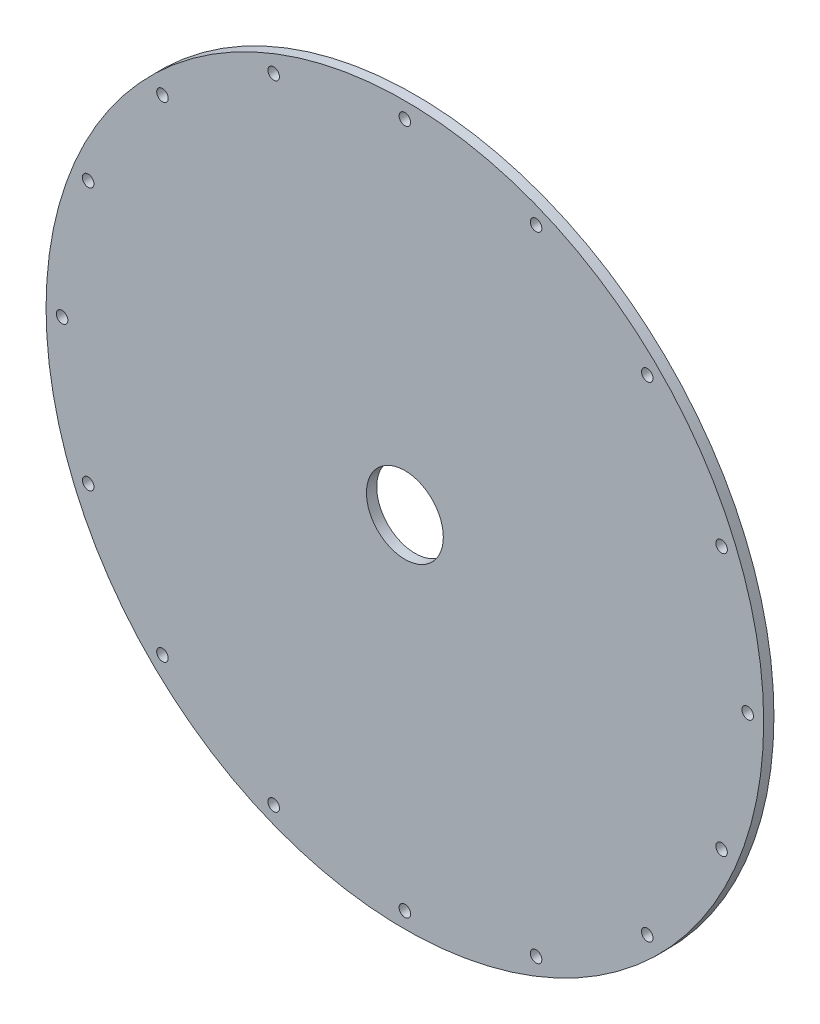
from build123d import *

# Parameters (mm, degrees)
SKETCH_1_R               = 280
SKETCH_1_R_2             = 30
EXTRUDE_1_DEPTH          = 8
HOLE_WIZARD_1_D          = 9
PATTERN_CIRCULAR_1_COUNT = 16


with BuildPart() as part:
    # Sketch 1 → Extrude 1 (new body)
    with BuildSketch(Plane.XY):
        Circle(SKETCH_1_R)
        Circle(SKETCH_1_R_2, mode=Mode.SUBTRACT)
    extrude(amount=EXTRUDE_1_DEPTH)

    # Hole Wizard 1 (through all)
    with Locations(Plane.XY.offset(8)):
        with Locations((0, 267.5)):
            hole_wizard_1 = Hole(HOLE_WIZARD_1_D / 2)

    # Pattern Circular 1: Hole Wizard 1 ×16 about axis
    pattern_circular_1_axis = Axis((0, 0, 0), (0, 0, 1))
    for i in range(1, PATTERN_CIRCULAR_1_COUNT):
        add(hole_wizard_1.rotate(pattern_circular_1_axis, i * 360 / PATTERN_CIRCULAR_1_COUNT), mode=Mode.SUBTRACT)


solid = part.part
